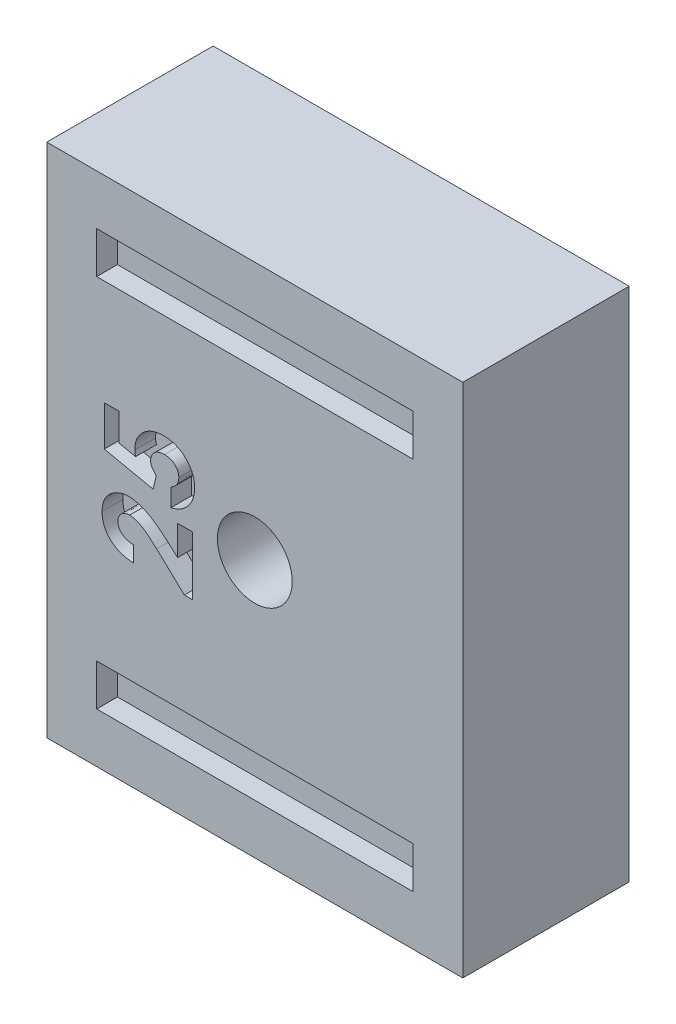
from build123d import *

# Parameters (mm, degrees)
SKETCH1_W           = 20
SKETCH1_H           = 24.8
SKETCH1_R           = 1.8
BOSS_EXTRUDE1_DEPTH = 8
CUT_EXTRUDE1_DEPTH  = 1
SKETCH4_W           = 15.2
SKETCH4_H           = 2
CUT_EXTRUDE2_DEPTH  = 1


with BuildPart() as part:
    # Sketch1 → Boss-Extrude1 (new body)
    with BuildSketch(Plane.XY):
        with Locations((-2.245418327, -5.870916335)):
            Rectangle(SKETCH1_W, SKETCH1_H)
        with Locations((-2.245418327, -5.870916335)):
            Circle(SKETCH1_R, mode=Mode.SUBTRACT)
    extrude(amount=BOSS_EXTRUDE1_DEPTH)

    # Sketch3 → Cut-Extrude1 (cut)
    with BuildSketch(Plane.XY.offset(8)):
        with BuildLine():
            Line((-8.067640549, -8.150403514), (-8.067640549, -8.910232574))
            add(Edge.make_bspline(
                [(-8.067640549, -8.910232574), (-8.125118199, -8.906952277), (-8.237426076, -8.900542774), (-8.400546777, -8.875019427), (-8.554715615, -8.840906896), (-8.6994691, -8.794990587), (-8.834868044, -8.738434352), (-8.960463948, -8.669830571), (-9.077156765, -8.591227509), (-9.182899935, -8.501040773), (-9.277966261, -8.402930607), (-9.361075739, -8.297148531), (-9.43064924, -8.183995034), (-9.487720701, -8.064226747), (-9.53338522, -7.938314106), (-9.563899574, -7.804984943), (-9.584568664, -7.665415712), (-9.586377, -7.569868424), (-9.587298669, -7.521170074)],
                knots=[0, 0, 0, 0, 1.198928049, 2.342633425, 3.435730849, 4.486331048, 5.502589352, 6.488331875, 7.46361919, 8.428949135, 9.378681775, 10.305958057, 11.226249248, 12.140413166, 13.066341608, 14.010670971, 14.986082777, 16, 16, 16, 16], degree=3))
            add(Edge.make_bspline(
                [(-9.587298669, -7.521170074), (-9.585558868, -7.461366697), (-9.582160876, -7.344565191), (-9.549344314, -7.175407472), (-9.499091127, -7.016578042), (-9.426080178, -6.869766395), (-9.334012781, -6.73522778), (-9.224023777, -6.613710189), (-9.094776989, -6.5075836), (-8.949994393, -6.417675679), (-8.796383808, -6.343326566), (-8.637834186, -6.290725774), (-8.478437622, -6.256334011), (-8.371120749, -6.252657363), (-8.317807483, -6.250830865)],
                knots=[0, 0, 0, 0, 1.075374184, 2.100304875, 3.089917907, 4.066149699, 5.039978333, 6.01615708, 7.006437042, 8.039858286, 9.077679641, 10.07047942, 11.041445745, 12, 12, 12, 12], degree=3))
            add(Edge.make_bspline(
                [(-8.317807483, -6.250830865), (-8.285559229, -6.251541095), (-8.22065146, -6.252970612), (-8.122430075, -6.262910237), (-8.022380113, -6.277821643), (-7.920587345, -6.300304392), (-7.81702329, -6.328342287), (-7.711377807, -6.362356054), (-7.604250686, -6.403135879), (-7.494433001, -6.449996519), (-7.381581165, -6.505917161), (-7.263950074, -6.570964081), (-7.141664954, -6.647311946), (-7.013526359, -6.732475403), (-6.88149082, -6.829804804), (-6.744092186, -6.936721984), (-6.601546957, -7.053765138), (-6.506220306, -7.136770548), (-6.457243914, -7.179416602)],
                knots=[0, 0, 0, 0, 0.728277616, 1.465842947, 2.227925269, 3.011838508, 3.818735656, 4.650581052, 5.517389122, 6.406849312, 7.346234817, 8.360743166, 9.441530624, 10.601362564, 11.834937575, 13.145232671, 14.533293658, 16, 16, 16, 16], degree=3))
            Line((-6.457243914, -7.179416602), (-5.950973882, -7.621236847))
            Line((-5.950973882, -7.621236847), (-5.950973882, -6.19655736))
            Line((-5.950973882, -6.19655736), (-5.245418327, -6.19655736))
            Line((-5.245418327, -6.19655736), (-5.245418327, -9.018779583))
            Line((-5.245418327, -9.018779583), (-5.630420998, -9.018779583))
            Line((-5.630420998, -9.018779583), (-6.96436197, -7.765400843))
            add(Edge.make_bspline(
                [(-6.96436197, -7.765400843), (-7.003273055, -7.729111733), (-7.078632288, -7.658830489), (-7.189311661, -7.558836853), (-7.294321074, -7.468318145), (-7.394878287, -7.38929835), (-7.487578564, -7.316996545), (-7.57592633, -7.256510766), (-7.657433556, -7.203835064), (-7.756787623, -7.148809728), (-7.874390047, -7.095351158), (-8.009789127, -7.046330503), (-8.13929021, -7.016748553), (-8.223826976, -7.012633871), (-8.264382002, -7.010659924)],
                knots=[0, 0, 0, 0, 1.246192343, 2.413505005, 3.49357156, 4.492416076, 5.408771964, 6.246246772, 6.999304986, 7.680960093, 8.904522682, 10.020616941, 11.0504258, 12, 12, 12, 12], degree=3))
            add(Edge.make_bspline(
                [(-8.264382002, -7.010659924), (-8.303617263, -7.012131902), (-8.379641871, -7.014984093), (-8.487786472, -7.046327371), (-8.585700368, -7.094885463), (-8.670457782, -7.163310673), (-8.740108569, -7.246195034), (-8.791912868, -7.341975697), (-8.821803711, -7.44987177), (-8.825544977, -7.525508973), (-8.827469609, -7.564419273)],
                knots=[0, 0, 0, 0, 1.062038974, 2.057870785, 3.028805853, 4.01125022, 4.991535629, 5.949134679, 6.94496649, 8, 8, 8, 8], degree=3))
            add(Edge.make_bspline(
                [(-8.827469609, -7.564419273), (-8.826758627, -7.584520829), (-8.825358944, -7.624093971), (-8.816041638, -7.682263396), (-8.799620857, -7.737615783), (-8.777619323, -7.790767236), (-8.748456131, -7.841150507), (-8.71250785, -7.888638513), (-8.670688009, -7.933731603), (-8.623127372, -7.976222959), (-8.570049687, -8.01489564), (-8.51193971, -8.049244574), (-8.448833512, -8.077645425), (-8.381564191, -8.102650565), (-8.30940922, -8.121935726), (-8.232800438, -8.135977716), (-8.151862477, -8.146652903), (-8.09622524, -8.149130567), (-8.067640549, -8.150403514)],
                knots=[0, 0, 0, 0, 0.903469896, 1.778625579, 2.63899355, 3.493148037, 4.358286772, 5.247621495, 6.164656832, 7.118446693, 8.109501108, 9.111810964, 10.146451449, 11.215617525, 12.33435995, 13.498009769, 14.714554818, 16, 16, 16, 16], degree=3))
        make_face()
        with BuildLine():
            Line((-9.47875166, -4.867704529), (-9.47875166, -2.940147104))
            Line((-9.47875166, -2.940147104), (-8.773196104, -2.940147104))
            Line((-8.773196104, -2.940147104), (-8.773196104, -4.265607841))
            Line((-8.773196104, -4.265607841), (-7.972661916, -4.430972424))
            add(Edge.make_bspline(
                [(-7.972661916, -4.430972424), (-7.978937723, -4.408439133), (-7.991314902, -4.363998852), (-8.003727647, -4.297049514), (-8.011773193, -4.232166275), (-8.012846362, -4.18959029), (-8.013367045, -4.168933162)],
                knots=[0, 0, 0, 0, 1.05461699, 2.079921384, 3.068411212, 4, 4, 4, 4], degree=3))
            add(Edge.make_bspline(
                [(-8.013367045, -4.168933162), (-8.012335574, -4.123919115), (-8.010302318, -4.035186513), (-7.991000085, -3.905381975), (-7.960599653, -3.781086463), (-7.917242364, -3.662680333), (-7.860811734, -3.550279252), (-7.792546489, -3.443746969), (-7.712326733, -3.342952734), (-7.620102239, -3.249687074), (-7.518837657, -3.163990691), (-7.409309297, -3.089482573), (-7.293078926, -3.025847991), (-7.16942406, -2.975235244), (-7.039121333, -2.93528735), (-6.902087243, -2.906420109), (-6.758159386, -2.889349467), (-6.659967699, -2.887047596), (-6.609888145, -2.8858736)],
                knots=[0, 0, 0, 0, 1.01440847, 1.999622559, 2.951875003, 3.895578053, 4.836219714, 5.782137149, 6.743708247, 7.735272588, 8.734977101, 9.730283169, 10.717124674, 11.717316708, 12.737475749, 13.78628267, 14.87096371, 16, 16, 16, 16], degree=3))
            add(Edge.make_bspline(
                [(-6.609888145, -2.8858736), (-6.559240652, -2.887309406), (-6.459298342, -2.890142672), (-6.312337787, -2.908595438), (-6.171621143, -2.941255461), (-6.036835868, -2.985729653), (-5.909142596, -3.045499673), (-5.786174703, -3.115354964), (-5.670573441, -3.200362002), (-5.561994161, -3.296410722), (-5.462685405, -3.401252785), (-5.37555021, -3.513159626), (-5.300930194, -3.63025316), (-5.241747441, -3.754190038), (-5.194687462, -3.883074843), (-5.160502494, -4.017354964), (-5.140882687, -4.157609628), (-5.138223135, -4.252827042), (-5.136871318, -4.301224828)],
                knots=[0, 0, 0, 0, 1.068214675, 2.107899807, 3.117335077, 4.110871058, 5.095206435, 6.086091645, 7.088956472, 8.115291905, 9.140102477, 10.129911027, 11.102477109, 12.062389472, 13.02046727, 13.992137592, 14.979429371, 16, 16, 16, 16], degree=3))
            add(Edge.make_bspline(
                [(-5.136871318, -4.301224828), (-5.138013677, -4.344496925), (-5.140266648, -4.429838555), (-5.153162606, -4.55574327), (-5.178773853, -4.676495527), (-5.210928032, -4.793285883), (-5.25525075, -4.904499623), (-5.306184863, -5.012428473), (-5.370131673, -5.113823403), (-5.440578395, -5.211564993), (-5.520584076, -5.301895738), (-5.607037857, -5.385765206), (-5.701555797, -5.459983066), (-5.802300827, -5.527314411), (-5.911154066, -5.584100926), (-6.02615747, -5.634864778), (-6.148605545, -5.676335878), (-6.233481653, -5.697394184), (-6.276614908, -5.708095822)],
                knots=[0, 0, 0, 0, 1.055144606, 2.080965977, 3.079696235, 4.061281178, 5.030010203, 5.994686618, 6.966205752, 7.947572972, 8.929036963, 9.903776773, 10.879904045, 11.854643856, 12.853445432, 13.868704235, 14.916895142, 16, 16, 16, 16], degree=3))
            Line((-6.276614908, -5.708095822), (-6.276614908, -4.839719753))
            add(Edge.make_bspline(
                [(-6.276614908, -4.839719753), (-6.246717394, -4.823850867), (-6.188614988, -4.793011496), (-6.111593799, -4.734259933), (-6.045589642, -4.668939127), (-5.991823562, -4.595983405), (-5.949218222, -4.517814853), (-5.918250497, -4.434828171), (-5.900081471, -4.347524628), (-5.897834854, -4.288022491), (-5.896700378, -4.25797563)],
                knots=[0, 0, 0, 0, 1.10506944, 2.147576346, 3.153981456, 4.13180336, 5.099527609, 6.055753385, 7.01821161, 8, 8, 8, 8], degree=3))
            add(Edge.make_bspline(
                [(-5.896700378, -4.25797563), (-5.897488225, -4.237035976), (-5.899038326, -4.195836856), (-5.907238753, -4.135136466), (-5.922770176, -4.077195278), (-5.944277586, -4.021582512), (-5.971099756, -3.968148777), (-6.004960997, -3.917660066), (-6.043936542, -3.869237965), (-6.088661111, -3.823619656), (-6.138518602, -3.782302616), (-6.192093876, -3.746072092), (-6.248196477, -3.713677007), (-6.309048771, -3.689681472), (-6.372833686, -3.670031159), (-6.440032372, -3.655559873), (-6.510723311, -3.646911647), (-6.558982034, -3.646111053), (-6.583599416, -3.645702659)],
                knots=[0, 0, 0, 0, 0.978869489, 1.925942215, 2.855067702, 3.774946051, 4.70828698, 5.642468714, 6.60995405, 7.609372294, 8.622401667, 9.629904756, 10.629323, 11.642352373, 12.678539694, 13.745912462, 14.850161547, 16, 16, 16, 16], degree=3))
            add(Edge.make_bspline(
                [(-6.583599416, -3.645702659), (-6.607645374, -3.646176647), (-6.654451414, -3.647099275), (-6.723179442, -3.654731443), (-6.788389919, -3.668385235), (-6.85058223, -3.686988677), (-6.909378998, -3.710803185), (-6.965129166, -3.739906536), (-7.017554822, -3.774421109), (-7.065574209, -3.814539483), (-7.109659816, -3.8573001), (-7.148071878, -3.903314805), (-7.180391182, -3.951715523), (-7.206797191, -4.002412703), (-7.228675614, -4.054941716), (-7.242273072, -4.110487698), (-7.252651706, -4.167699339), (-7.253239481, -4.206761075), (-7.253537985, -4.22659876)],
                knots=[0, 0, 0, 0, 1.166353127, 2.270334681, 3.348811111, 4.394351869, 5.415506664, 6.421447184, 7.440758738, 8.453871, 9.452682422, 10.416618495, 11.356052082, 12.270018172, 13.186757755, 14.10810127, 15.039190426, 16, 16, 16, 16], degree=3))
            add(Edge.make_bspline(
                [(-7.253537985, -4.22659876), (-7.252742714, -4.248150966), (-7.251148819, -4.291346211), (-7.237498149, -4.355300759), (-7.217293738, -4.419048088), (-7.187125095, -4.481758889), (-7.148417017, -4.544022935), (-7.101650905, -4.605947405), (-7.046079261, -4.667281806), (-7.004518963, -4.706035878), (-6.983018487, -4.726084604)],
                knots=[0, 0, 0, 0, 0.882519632, 1.768758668, 2.670168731, 3.618680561, 4.612333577, 5.671392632, 6.795336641, 8, 8, 8, 8], degree=3))
            Line((-6.983018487, -4.726084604), (-7.129726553, -5.365494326))
            Line((-7.129726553, -5.365494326), (-9.47875166, -4.867704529))
        make_face()
    extrude(amount=-CUT_EXTRUDE1_DEPTH, mode=Mode.SUBTRACT)

    # Sketch4 → Cut-Extrude2 (cut)
    with BuildSketch(Plane.XY.offset(8)):
        with Locations((-2.245418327, -14.870916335)):
            Rectangle(SKETCH4_W, SKETCH4_H)
        with Locations((-2.245418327, 3.129083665)):
            Rectangle(SKETCH4_W, SKETCH4_H)
    extrude(amount=-CUT_EXTRUDE2_DEPTH, mode=Mode.SUBTRACT)


solid = part.part
